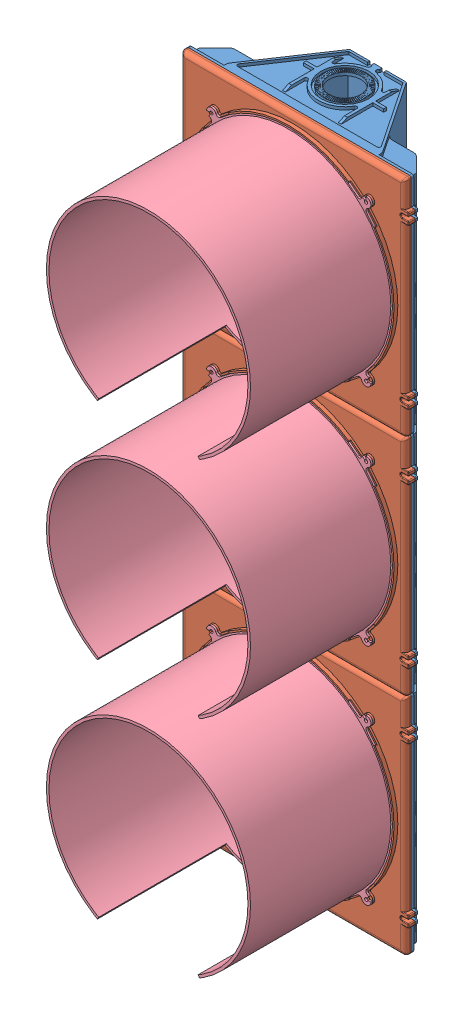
SolidWorks assembly ASY.SLDASM, configuration Predeterminado (file format 4700). Lengths in mm.
Overall size (365 1056.1 386).
12 component instances, 4 part files, 9 mates.
Components (placement in the parent):
- SEMAFORO MODULAR 300mm-1: SEMAFORO MODULAR 300mm.SLDPRT [Predeterminado] at (-268.0516 -175.7812 70) size (365 352.1 152)
- SEMAFORO MODULAR 300mm-2: SEMAFORO MODULAR 300mm.SLDPRT [Predeterminado] at (-268.0516 176.2188 70) size (365 352.1 152)
- SEMAFORO MODULAR 300mm-3: SEMAFORO MODULAR 300mm.SLDPRT [Predeterminado] at (-268.0516 528.2188 70) size (365 352.1 152)
- tapa SEMAFORO MODULAR 300mm-1: tapa SEMAFORO MODULAR 300mm.SLDPRT [Predeterminado] at (-92.0516 0.2188 74) size (365 352 36)
- tapa SEMAFORO MODULAR 300mm-2: tapa SEMAFORO MODULAR 300mm.SLDPRT [Predeterminado] at (-92.0516 352.2188 74) size (365 352 36)
- tapa SEMAFORO MODULAR 300mm-3: tapa SEMAFORO MODULAR 300mm.SLDPRT [Predeterminado] at (-92.0516 704.2188 74) size (365 352 36)
- LENTE SEMAFORO-1: LENTE SEMAFORO.SLDPRT [Predeterminado] at (-92.0516 0.2188 78) size (300 300 33)
- LENTE SEMAFORO-2: LENTE SEMAFORO.SLDPRT [Predeterminado] at (-92.0516 352.2188 78) size (300 300 33)
- LENTE SEMAFORO-3: LENTE SEMAFORO.SLDPRT [Predeterminado] at (-92.0516 704.2188 78) size (300 300 33)
- PROTECCION LENTE SEMAFORO 300MM-1: PROTECCION LENTE SEMAFORO 300MM.SLDPRT [Predeterminado] at (-92.0516 0.2188 87) size (325 325 223)
- PROTECCION LENTE SEMAFORO 300MM-2: PROTECCION LENTE SEMAFORO 300MM.SLDPRT [Predeterminado] at (-92.0516 352.2188 87) size (325 325 223)
- PROTECCION LENTE SEMAFORO 300MM-3: PROTECCION LENTE SEMAFORO 300MM.SLDPRT [Predeterminado] at (-92.0516 704.2188 87) size (325 325 223)
Mates (geometry in assembly coordinates):
- Concéntrica1: concentric aligned: cylinder of SEMAFORO MODULAR 300mm-3 through (-269.0516 813.2188 60) axis (0 1 0) radius 1.585; cylinder of tapa SEMAFORO MODULAR 300mm-1 through (-269.0516 121.2188 60) axis (0 1 0) radius 1.585
- Coincidente1: coincident anti-aligned: plane of SEMAFORO MODULAR 300mm-1 through (-288.295 121.2188 70) normal (0 1 0); plane of tapa SEMAFORO MODULAR 300mm-1 through (-269.0516 121.2188 60) normal (0 -1 0)
- Concéntrica2: concentric aligned: circle of tapa SEMAFORO MODULAR 300mm-1; circle of LENTE SEMAFORO-1
- Coincidente2: coincident anti-aligned: plane of tapa SEMAFORO MODULAR 300mm-1 through (-92.0516 0.2188 81) normal (0 0 -1); plane of LENTE SEMAFORO-1 through (-92.0516 0.2188 81) normal (0 0 1)
- Concéntrica4: concentric aligned: circle of tapa SEMAFORO MODULAR 300mm-1; circle of PROTECCION LENTE SEMAFORO 300MM-1
- Coincidente4: coincident anti-aligned: plane of tapa SEMAFORO MODULAR 300mm-1 through (-92.0516 0.2188 87) normal (0 0 1); plane of PROTECCION LENTE SEMAFORO 300MM-1 through (29.265 121.5354 87) normal (0 0 -1)
- Concéntrica5: concentric anti-aligned: cylinder of tapa SEMAFORO MODULAR 300mm-1 through (29.265 121.5354 54) axis (0 0 1) radius 2.5; cylinder of PROTECCION LENTE SEMAFORO 300MM-1 through (29.265 121.5354 90) axis (0 0 -1) radius 2.5
- Coincidente10: coincident anti-aligned: plane of SEMAFORO MODULAR 300mm-2 through (80.9484 179.2188 74) normal (0 0 1); plane of tapa SEMAFORO MODULAR 300mm-2 through (-89.5516 -38.9916 74) normal (0 0 -1)
- Coincidente11: coincident anti-aligned: plane of tapa SEMAFORO MODULAR 300mm-1 through (-92.0516 0.2188 87) normal (0 0 1); plane of PROTECCION LENTE SEMAFORO 300MM-1 through (29.265 121.5354 87) normal (0 0 -1)
